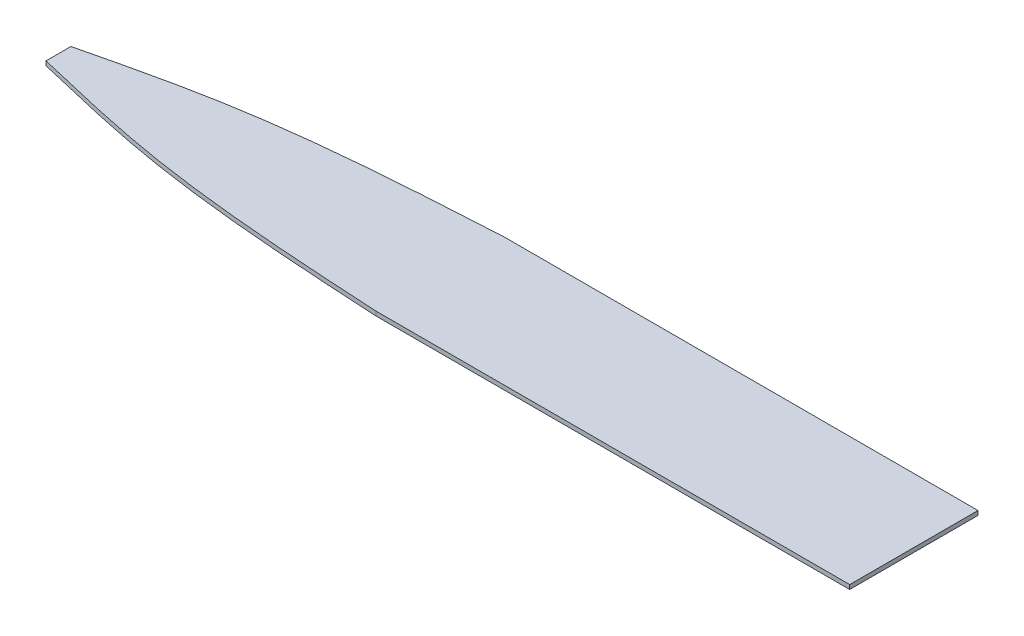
ISO-10303-21;
HEADER;
FILE_DESCRIPTION(('STEP AP214'),'2;1');
FILE_NAME('part.step','',(''),(''),'','','');
FILE_SCHEMA(('AUTOMOTIVE_DESIGN { 1 0 10303 214 1 1 1 1 }'));
ENDSEC;
DATA;
#1=APPLICATION_CONTEXT('core data for automotive mechanical design processes');
#2=APPLICATION_PROTOCOL_DEFINITION('international standard','automotive_design',2000,#1);
#3=PRODUCT_CONTEXT('',#1,'mechanical');
#4=PRODUCT('Part','Part','',(#3));
#5=PRODUCT_RELATED_PRODUCT_CATEGORY('part','',(#4));
#6=PRODUCT_DEFINITION_FORMATION('','',#4);
#7=PRODUCT_DEFINITION_CONTEXT('part definition',#1,'design');
#8=PRODUCT_DEFINITION('design','',#6,#7);
#9=PRODUCT_DEFINITION_SHAPE('','',#8);
#10=(LENGTH_UNIT() NAMED_UNIT(*) SI_UNIT(.MILLI.,.METRE.));
#11=(NAMED_UNIT(*) PLANE_ANGLE_UNIT() SI_UNIT($,.RADIAN.));
#12=(NAMED_UNIT(*) SI_UNIT($,.STERADIAN.) SOLID_ANGLE_UNIT());
#13=UNCERTAINTY_MEASURE_WITH_UNIT(LENGTH_MEASURE(1.E-05),#10,'distance_accuracy_value','');
#14=(GEOMETRIC_REPRESENTATION_CONTEXT(3) GLOBAL_UNCERTAINTY_ASSIGNED_CONTEXT((#13)) GLOBAL_UNIT_ASSIGNED_CONTEXT((#10,
#11,#12)) REPRESENTATION_CONTEXT('',''));
#15=CARTESIAN_POINT('',(0.,0.,0.));
#16=DIRECTION('',(0.,0.,1.));
#17=DIRECTION('',(1.,0.,0.));
#18=AXIS2_PLACEMENT_3D('',#15,#16,#17);
#19=CARTESIAN_POINT('',(99.1527289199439,1.,15.));
#20=DIRECTION('',(-1.,0.,0.));
#21=DIRECTION('',(0.,0.,1.));
#22=AXIS2_PLACEMENT_3D('',#19,#20,#21);
#23=PLANE('',#22);
#24=DIRECTION('',(0.,0.,-1.));
#25=VECTOR('',#24,1.);
#26=CARTESIAN_POINT('',(99.1527289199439,0.,15.));
#27=LINE('',#26,#25);
#28=CARTESIAN_POINT('',(99.1527289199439,0.,15.));
#29=VERTEX_POINT('',#28);
#30=CARTESIAN_POINT('',(99.1527289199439,0.,-15.));
#31=VERTEX_POINT('',#30);
#32=EDGE_CURVE('E82',#29,#31,#27,.T.);
#33=ORIENTED_EDGE('',*,*,#32,.T.);
#34=DIRECTION('',(0.,-1.,0.));
#35=VECTOR('',#34,1.);
#36=CARTESIAN_POINT('',(99.1527289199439,1.,-15.));
#37=LINE('',#36,#35);
#38=CARTESIAN_POINT('',(99.1527289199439,1.,-15.));
#39=VERTEX_POINT('',#38);
#40=EDGE_CURVE('E11',#39,#31,#37,.T.);
#41=ORIENTED_EDGE('',*,*,#40,.F.);
#42=DIRECTION('',(0.,0.,-1.));
#43=VECTOR('',#42,1.);
#44=CARTESIAN_POINT('',(99.1527289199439,1.,15.));
#45=LINE('',#44,#43);
#46=CARTESIAN_POINT('',(99.1527289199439,1.,15.));
#47=VERTEX_POINT('',#46);
#48=EDGE_CURVE('E115',#47,#39,#45,.T.);
#49=ORIENTED_EDGE('',*,*,#48,.F.);
#50=DIRECTION('',(0.,-1.,0.));
#51=VECTOR('',#50,1.);
#52=CARTESIAN_POINT('',(99.1527289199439,1.,15.));
#53=LINE('',#52,#51);
#54=EDGE_CURVE('E95',#47,#29,#53,.T.);
#55=ORIENTED_EDGE('',*,*,#54,.T.);
#56=EDGE_LOOP('',(#33,#41,#49,#55));
#57=FACE_BOUND('',#56,.T.);
#58=ADVANCED_FACE('F26',(#57),#23,.F.);
#59=CARTESIAN_POINT('',(-11.6557147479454,1.,-15.));
#60=DIRECTION('',(0.,0.,1.));
#61=DIRECTION('',(1.,0.,0.));
#62=AXIS2_PLACEMENT_3D('',#59,#60,#61);
#63=PLANE('',#62);
#64=DIRECTION('',(-1.,0.,0.));
#65=VECTOR('',#64,1.);
#66=CARTESIAN_POINT('',(-11.6557147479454,0.,-15.));
#67=LINE('',#66,#65);
#68=CARTESIAN_POINT('',(-11.6557147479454,0.,-15.));
#69=VERTEX_POINT('',#68);
#70=EDGE_CURVE('E78',#31,#69,#67,.T.);
#71=ORIENTED_EDGE('',*,*,#70,.T.);
#72=DIRECTION('',(0.,-1.,0.));
#73=VECTOR('',#72,1.);
#74=CARTESIAN_POINT('',(-11.6557147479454,1.,-15.));
#75=LINE('',#74,#73);
#76=CARTESIAN_POINT('',(-11.6557147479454,1.,-15.));
#77=VERTEX_POINT('',#76);
#78=EDGE_CURVE('E33',#77,#69,#75,.T.);
#79=ORIENTED_EDGE('',*,*,#78,.F.);
#80=DIRECTION('',(-1.,0.,0.));
#81=VECTOR('',#80,1.);
#82=CARTESIAN_POINT('',(-11.6557147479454,1.,-15.));
#83=LINE('',#82,#81);
#84=EDGE_CURVE('E91',#39,#77,#83,.T.);
#85=ORIENTED_EDGE('',*,*,#84,.F.);
#86=ORIENTED_EDGE('',*,*,#40,.T.);
#87=EDGE_LOOP('',(#71,#79,#85,#86));
#88=FACE_BOUND('',#87,.T.);
#89=ADVANCED_FACE('F90',(#88),#63,.F.);
#90=CARTESIAN_POINT('',(-11.6557147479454,1.,-15.));
#91=CARTESIAN_POINT('',(-32.3120274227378,1.,-13.8331450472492));
#92=CARTESIAN_POINT('',(-62.4110734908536,1.,-12.1328792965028));
#93=CARTESIAN_POINT('',(-91.6685550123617,1.,-5.11545056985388));
#94=CARTESIAN_POINT('',(-100.847271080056,1.,-2.91392868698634));
#95=B_SPLINE_CURVE_WITH_KNOTS('',3,(#90,#91,#92,#93,#94),.UNSPECIFIED.,.F.,.F.,(4,1,4),(0.,
0.686277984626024,1.),.UNSPECIFIED.);
#96=DIRECTION('',(0.,-1.,0.));
#97=VECTOR('',#96,1.);
#98=SURFACE_OF_LINEAR_EXTRUSION('',#95,#97);
#99=CARTESIAN_POINT('',(-11.6557147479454,0.,-15.));
#100=CARTESIAN_POINT('',(-32.3120274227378,0.,-13.8331450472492));
#101=CARTESIAN_POINT('',(-62.4110734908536,0.,-12.1328792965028));
#102=CARTESIAN_POINT('',(-91.6685550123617,0.,-5.11545056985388));
#103=CARTESIAN_POINT('',(-100.847271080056,0.,-2.91392868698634));
#104=B_SPLINE_CURVE_WITH_KNOTS('',3,(#99,#100,#101,#102,#103),.UNSPECIFIED.,.F.,.F.,(4,1,4),(0.,
0.686277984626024,1.),.UNSPECIFIED.);
#105=CARTESIAN_POINT('',(-100.847271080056,0.,-2.91392868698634));
#106=VERTEX_POINT('',#105);
#107=EDGE_CURVE('E84',#69,#106,#104,.T.);
#108=ORIENTED_EDGE('',*,*,#107,.T.);
#109=DIRECTION('',(0.,-1.,0.));
#110=VECTOR('',#109,1.);
#111=CARTESIAN_POINT('',(-100.847271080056,1.,-2.91392868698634));
#112=LINE('',#111,#110);
#113=CARTESIAN_POINT('',(-100.847271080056,1.,-2.91392868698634));
#114=VERTEX_POINT('',#113);
#115=EDGE_CURVE('E198',#114,#106,#112,.T.);
#116=ORIENTED_EDGE('',*,*,#115,.F.);
#117=EDGE_CURVE('E118',#77,#114,#95,.T.);
#118=ORIENTED_EDGE('',*,*,#117,.F.);
#119=ORIENTED_EDGE('',*,*,#78,.T.);
#120=EDGE_LOOP('',(#108,#116,#118,#119));
#121=FACE_BOUND('',#120,.T.);
#122=ADVANCED_FACE('F129',(#121),#98,.F.);
#123=CARTESIAN_POINT('',(-100.847271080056,1.,2.91392868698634));
#124=DIRECTION('',(1.,0.,0.));
#125=DIRECTION('',(0.,0.,-1.));
#126=AXIS2_PLACEMENT_3D('',#123,#124,#125);
#127=PLANE('',#126);
#128=DIRECTION('',(0.,0.,1.));
#129=VECTOR('',#128,1.);
#130=CARTESIAN_POINT('',(-100.847271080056,0.,2.91392868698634));
#131=LINE('',#130,#129);
#132=CARTESIAN_POINT('',(-100.847271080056,0.,2.91392868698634));
#133=VERTEX_POINT('',#132);
#134=EDGE_CURVE('E101',#106,#133,#131,.T.);
#135=ORIENTED_EDGE('',*,*,#134,.T.);
#136=DIRECTION('',(0.,-1.,0.));
#137=VECTOR('',#136,1.);
#138=CARTESIAN_POINT('',(-100.847271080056,1.,2.91392868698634));
#139=LINE('',#138,#137);
#140=CARTESIAN_POINT('',(-100.847271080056,1.,2.91392868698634));
#141=VERTEX_POINT('',#140);
#142=EDGE_CURVE('E195',#141,#133,#139,.T.);
#143=ORIENTED_EDGE('',*,*,#142,.F.);
#144=DIRECTION('',(0.,0.,1.));
#145=VECTOR('',#144,1.);
#146=CARTESIAN_POINT('',(-100.847271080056,1.,2.91392868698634));
#147=LINE('',#146,#145);
#148=EDGE_CURVE('E123',#114,#141,#147,.T.);
#149=ORIENTED_EDGE('',*,*,#148,.F.);
#150=ORIENTED_EDGE('',*,*,#115,.T.);
#151=EDGE_LOOP('',(#135,#143,#149,#150));
#152=FACE_BOUND('',#151,.T.);
#153=ADVANCED_FACE('F132',(#152),#127,.F.);
#154=CARTESIAN_POINT('',(-100.847271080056,1.,2.91392868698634));
#155=CARTESIAN_POINT('',(-91.6685550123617,1.,5.11545056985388));
#156=CARTESIAN_POINT('',(-62.4110734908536,1.,12.1328792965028));
#157=CARTESIAN_POINT('',(-32.3120274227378,1.,13.8331450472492));
#158=CARTESIAN_POINT('',(-11.6557147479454,1.,15.));
#159=B_SPLINE_CURVE_WITH_KNOTS('',3,(#154,#155,#156,#157,#158),.UNSPECIFIED.,.F.,.F.,(4,1,4),
(0.,0.313722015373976,1.),.UNSPECIFIED.);
#160=DIRECTION('',(0.,-1.,0.));
#161=VECTOR('',#160,1.);
#162=SURFACE_OF_LINEAR_EXTRUSION('',#159,#161);
#163=CARTESIAN_POINT('',(-100.847271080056,0.,2.91392868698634));
#164=CARTESIAN_POINT('',(-91.6685550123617,0.,5.11545056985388));
#165=CARTESIAN_POINT('',(-62.4110734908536,0.,12.1328792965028));
#166=CARTESIAN_POINT('',(-32.3120274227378,0.,13.8331450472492));
#167=CARTESIAN_POINT('',(-11.6557147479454,0.,15.));
#168=B_SPLINE_CURVE_WITH_KNOTS('',3,(#163,#164,#165,#166,#167),.UNSPECIFIED.,.F.,.F.,(4,1,4),
(0.,0.313722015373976,1.),.UNSPECIFIED.);
#169=CARTESIAN_POINT('',(-11.6557147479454,0.,15.));
#170=VERTEX_POINT('',#169);
#171=EDGE_CURVE('E106',#133,#170,#168,.T.);
#172=ORIENTED_EDGE('',*,*,#171,.T.);
#173=DIRECTION('',(0.,-1.,0.));
#174=VECTOR('',#173,1.);
#175=CARTESIAN_POINT('',(-11.6557147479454,1.,15.));
#176=LINE('',#175,#174);
#177=CARTESIAN_POINT('',(-11.6557147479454,1.,15.));
#178=VERTEX_POINT('',#177);
#179=EDGE_CURVE('E192',#178,#170,#176,.T.);
#180=ORIENTED_EDGE('',*,*,#179,.F.);
#181=EDGE_CURVE('E45',#141,#178,#159,.T.);
#182=ORIENTED_EDGE('',*,*,#181,.F.);
#183=ORIENTED_EDGE('',*,*,#142,.T.);
#184=EDGE_LOOP('',(#172,#180,#182,#183));
#185=FACE_BOUND('',#184,.T.);
#186=ADVANCED_FACE('F154',(#185),#162,.F.);
#187=CARTESIAN_POINT('',(-11.6557147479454,1.,15.));
#188=DIRECTION('',(0.,0.,-1.));
#189=DIRECTION('',(-1.,0.,0.));
#190=AXIS2_PLACEMENT_3D('',#187,#188,#189);
#191=PLANE('',#190);
#192=DIRECTION('',(1.,0.,0.));
#193=VECTOR('',#192,1.);
#194=CARTESIAN_POINT('',(-11.6557147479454,0.,15.));
#195=LINE('',#194,#193);
#196=EDGE_CURVE('E110',#170,#29,#195,.T.);
#197=ORIENTED_EDGE('',*,*,#196,.T.);
#198=ORIENTED_EDGE('',*,*,#54,.F.);
#199=DIRECTION('',(1.,0.,0.));
#200=VECTOR('',#199,1.);
#201=CARTESIAN_POINT('',(-11.6557147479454,1.,15.));
#202=LINE('',#201,#200);
#203=EDGE_CURVE('E40',#178,#47,#202,.T.);
#204=ORIENTED_EDGE('',*,*,#203,.F.);
#205=ORIENTED_EDGE('',*,*,#179,.T.);
#206=EDGE_LOOP('',(#197,#198,#204,#205));
#207=FACE_BOUND('',#206,.T.);
#208=ADVANCED_FACE('F161',(#207),#191,.F.);
#209=CARTESIAN_POINT('',(-56.6509996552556,1.,-11.4811230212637));
#210=DIRECTION('',(0.,1.,0.));
#211=DIRECTION('',(0.,0.,1.));
#212=AXIS2_PLACEMENT_3D('',#209,#210,#211);
#213=PLANE('',#212);
#214=ORIENTED_EDGE('',*,*,#48,.T.);
#215=ORIENTED_EDGE('',*,*,#84,.T.);
#216=ORIENTED_EDGE('',*,*,#117,.T.);
#217=ORIENTED_EDGE('',*,*,#148,.T.);
#218=ORIENTED_EDGE('',*,*,#181,.T.);
#219=ORIENTED_EDGE('',*,*,#203,.T.);
#220=EDGE_LOOP('',(#214,#215,#216,#217,#218,#219));
#221=FACE_BOUND('',#220,.T.);
#222=ADVANCED_FACE('F168',(#221),#213,.T.);
#223=CARTESIAN_POINT('',(-56.6509996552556,0.,-11.4811230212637));
#224=DIRECTION('',(0.,1.,0.));
#225=DIRECTION('',(0.,0.,1.));
#226=AXIS2_PLACEMENT_3D('',#223,#224,#225);
#227=PLANE('',#226);
#228=ORIENTED_EDGE('',*,*,#32,.F.);
#229=ORIENTED_EDGE('',*,*,#196,.F.);
#230=ORIENTED_EDGE('',*,*,#171,.F.);
#231=ORIENTED_EDGE('',*,*,#134,.F.);
#232=ORIENTED_EDGE('',*,*,#107,.F.);
#233=ORIENTED_EDGE('',*,*,#70,.F.);
#234=EDGE_LOOP('',(#228,#229,#230,#231,#232,#233));
#235=FACE_BOUND('',#234,.T.);
#236=ADVANCED_FACE('F79',(#235),#227,.F.);
#237=CLOSED_SHELL('',(#58,#89,#122,#153,#186,#208,#222,#236));
#238=MANIFOLD_SOLID_BREP('B2',#237);
#239=ADVANCED_BREP_SHAPE_REPRESENTATION('',(#18,#238),#14);
#240=SHAPE_DEFINITION_REPRESENTATION(#9,#239);
ENDSEC;
END-ISO-10303-21;
